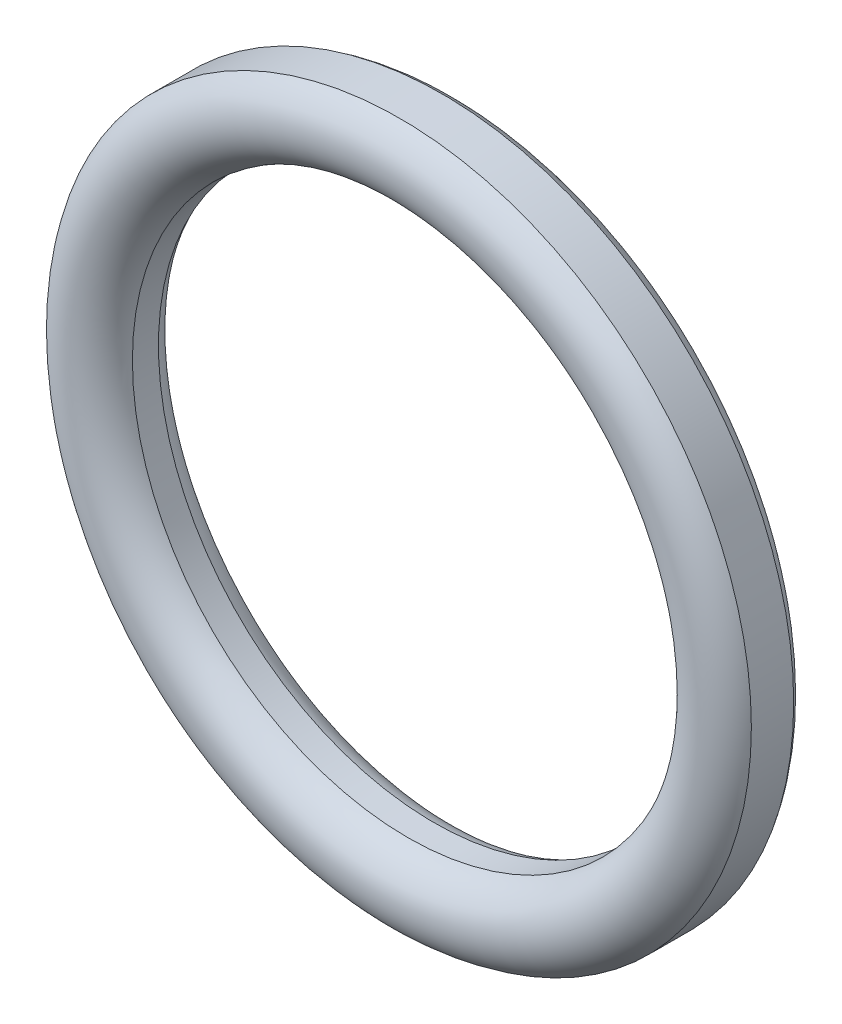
from build123d import *

# Parameters (mm, degrees)
SKETCH2_R               = 1.31
CUT_EXTRUDE1_DEPTH      = 16.865084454
CUT_EXTRUDE1_DEPTH_BACK = 16.865084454
SKETCH3_OUTSIDE_W       = 30.706
SKETCH3_OUTSIDE_H       = 30.706
SKETCH3_OUTSIDE_R       = 11
SKETCH3_OUTSIDE_R_2     = 8.625


with BuildPart() as part:
    # Base-Sweep: sweep along a path in Sketch1
    with BuildLine(Plane.XY) as base_sweep_path:
        CenterArc((0, 0), 9.87, 0, 360)
    # Sketch2 → Base-Sweep (sweep)
    with BuildSketch(Plane(origin=(0, 0, 0), x_dir=(0, 0, -1), z_dir=(1, 0, 0))):
        with Locations((0, 9.87)):
            Circle(SKETCH2_R)
    sweep(path=base_sweep_path.line)

    # Sketch3 outside → Cut-Extrude1 (cut, two sides: drawn at the far end of the back side and taken through both)
    # profile 1 of 2: a face of its own
    with BuildSketch(Plane.XY.offset(-CUT_EXTRUDE1_DEPTH_BACK)):
        Rectangle(SKETCH3_OUTSIDE_W, SKETCH3_OUTSIDE_H)
        Circle(SKETCH3_OUTSIDE_R, mode=Mode.SUBTRACT)
    # profile 2 of 2: a face of its own
    with BuildSketch(Plane.XY.offset(-CUT_EXTRUDE1_DEPTH_BACK)):
        Circle(SKETCH3_OUTSIDE_R_2)
    extrude(amount=CUT_EXTRUDE1_DEPTH + CUT_EXTRUDE1_DEPTH_BACK, mode=Mode.SUBTRACT)


solid = part.part
